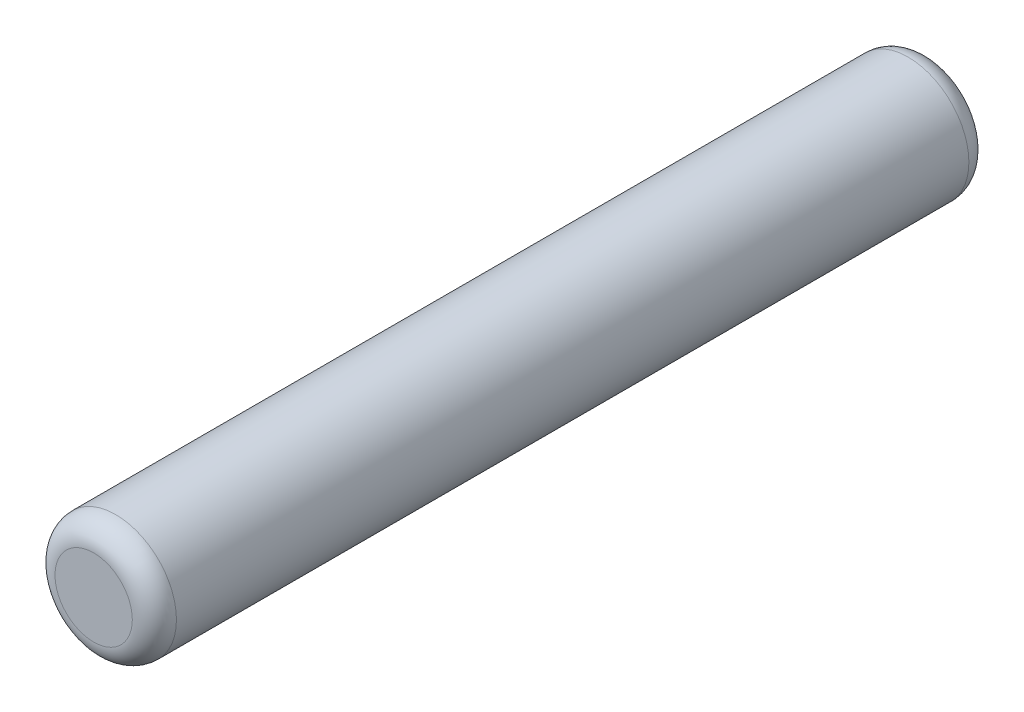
ISO-10303-21;
HEADER;
FILE_DESCRIPTION(('STEP AP214'),'2;1');
FILE_NAME('part.step','',(''),(''),'','','');
FILE_SCHEMA(('AUTOMOTIVE_DESIGN { 1 0 10303 214 1 1 1 1 }'));
ENDSEC;
DATA;
#1=APPLICATION_CONTEXT('core data for automotive mechanical design processes');
#2=APPLICATION_PROTOCOL_DEFINITION('international standard','automotive_design',2000,#1);
#3=PRODUCT_CONTEXT('',#1,'mechanical');
#4=PRODUCT('Part','Part','',(#3));
#5=PRODUCT_RELATED_PRODUCT_CATEGORY('part','',(#4));
#6=PRODUCT_DEFINITION_FORMATION('','',#4);
#7=PRODUCT_DEFINITION_CONTEXT('part definition',#1,'design');
#8=PRODUCT_DEFINITION('design','',#6,#7);
#9=PRODUCT_DEFINITION_SHAPE('','',#8);
#10=(LENGTH_UNIT() NAMED_UNIT(*) SI_UNIT(.MILLI.,.METRE.));
#11=(NAMED_UNIT(*) PLANE_ANGLE_UNIT() SI_UNIT($,.RADIAN.));
#12=(NAMED_UNIT(*) SI_UNIT($,.STERADIAN.) SOLID_ANGLE_UNIT());
#13=UNCERTAINTY_MEASURE_WITH_UNIT(LENGTH_MEASURE(1.E-05),#10,'distance_accuracy_value','');
#14=(GEOMETRIC_REPRESENTATION_CONTEXT(3) GLOBAL_UNCERTAINTY_ASSIGNED_CONTEXT((#13)) GLOBAL_UNIT_ASSIGNED_CONTEXT((#10,
#11,#12)) REPRESENTATION_CONTEXT('',''));
#15=CARTESIAN_POINT('',(0.,0.,0.));
#16=DIRECTION('',(0.,0.,1.));
#17=DIRECTION('',(1.,0.,0.));
#18=AXIS2_PLACEMENT_3D('',#15,#16,#17);
#19=CARTESIAN_POINT('',(0.,0.,-15.0495));
#20=DIRECTION('',(0.,0.,1.));
#21=DIRECTION('',(1.,0.,0.));
#22=AXIS2_PLACEMENT_3D('',#19,#20,#21);
#23=PLANE('',#22);
#24=CARTESIAN_POINT('',(0.,0.,-15.0495));
#25=DIRECTION('',(0.,0.,1.));
#26=DIRECTION('',(1.,0.,0.));
#27=AXIS2_PLACEMENT_3D('',#24,#25,#26);
#28=CIRCLE('',#27,1.39065);
#29=CARTESIAN_POINT('',(1.39065,0.,-15.0495));
#30=VERTEX_POINT('',#29);
#31=EDGE_CURVE('E10',#30,#30,#28,.T.);
#32=ORIENTED_EDGE('',*,*,#31,.F.);
#33=EDGE_LOOP('',(#32));
#34=FACE_BOUND('',#33,.T.);
#35=ADVANCED_FACE('F33',(#34),#23,.F.);
#36=CARTESIAN_POINT('',(0.,0.,-14.25575));
#37=DIRECTION('',(0.,0.,1.));
#38=DIRECTION('',(1.,0.,0.));
#39=AXIS2_PLACEMENT_3D('',#36,#37,#38);
#40=TOROIDAL_SURFACE('',#39,1.39065,0.79375);
#41=CARTESIAN_POINT('',(0.,0.,-14.25575));
#42=DIRECTION('',(0.,0.,1.));
#43=DIRECTION('',(1.,0.,0.));
#44=AXIS2_PLACEMENT_3D('',#41,#42,#43);
#45=CIRCLE('',#44,2.1844);
#46=CARTESIAN_POINT('',(2.1844,0.,-14.25575));
#47=VERTEX_POINT('',#46);
#48=EDGE_CURVE('E39',#47,#47,#45,.T.);
#49=ORIENTED_EDGE('',*,*,#48,.F.);
#50=EDGE_LOOP('',(#49));
#51=FACE_BOUND('',#50,.T.);
#52=ORIENTED_EDGE('',*,*,#31,.T.);
#53=EDGE_LOOP('',(#52));
#54=FACE_BOUND('',#53,.T.);
#55=ADVANCED_FACE('F63',(#51,#54),#40,.T.);
#56=CARTESIAN_POINT('',(0.,0.,40.4232739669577));
#57=DIRECTION('',(0.,0.,1.));
#58=DIRECTION('',(1.,0.,0.));
#59=AXIS2_PLACEMENT_3D('',#56,#57,#58);
#60=CYLINDRICAL_SURFACE('',#59,2.1844);
#61=CARTESIAN_POINT('',(0.,0.,14.25575));
#62=DIRECTION('',(0.,0.,1.));
#63=DIRECTION('',(1.,0.,0.));
#64=AXIS2_PLACEMENT_3D('',#61,#62,#63);
#65=CIRCLE('',#64,2.1844);
#66=CARTESIAN_POINT('',(2.1844,0.,14.25575));
#67=VERTEX_POINT('',#66);
#68=EDGE_CURVE('E43',#67,#67,#65,.T.);
#69=ORIENTED_EDGE('',*,*,#68,.F.);
#70=EDGE_LOOP('',(#69));
#71=FACE_BOUND('',#70,.T.);
#72=ORIENTED_EDGE('',*,*,#48,.T.);
#73=EDGE_LOOP('',(#72));
#74=FACE_BOUND('',#73,.T.);
#75=ADVANCED_FACE('F58',(#71,#74),#60,.T.);
#76=CARTESIAN_POINT('',(0.,0.,14.25575));
#77=DIRECTION('',(0.,0.,1.));
#78=DIRECTION('',(1.,0.,0.));
#79=AXIS2_PLACEMENT_3D('',#76,#77,#78);
#80=TOROIDAL_SURFACE('',#79,1.39065,0.79375);
#81=CARTESIAN_POINT('',(0.,0.,15.0495));
#82=DIRECTION('',(0.,0.,1.));
#83=DIRECTION('',(1.,0.,0.));
#84=AXIS2_PLACEMENT_3D('',#81,#82,#83);
#85=CIRCLE('',#84,1.39065);
#86=CARTESIAN_POINT('',(1.39065,0.,15.0495));
#87=VERTEX_POINT('',#86);
#88=EDGE_CURVE('E47',#87,#87,#85,.T.);
#89=ORIENTED_EDGE('',*,*,#88,.F.);
#90=EDGE_LOOP('',(#89));
#91=FACE_BOUND('',#90,.T.);
#92=ORIENTED_EDGE('',*,*,#68,.T.);
#93=EDGE_LOOP('',(#92));
#94=FACE_BOUND('',#93,.T.);
#95=ADVANCED_FACE('F55',(#91,#94),#80,.T.);
#96=CARTESIAN_POINT('',(0.,0.,15.0495));
#97=DIRECTION('',(0.,0.,-1.));
#98=DIRECTION('',(-1.,0.,0.));
#99=AXIS2_PLACEMENT_3D('',#96,#97,#98);
#100=PLANE('',#99);
#101=ORIENTED_EDGE('',*,*,#88,.T.);
#102=EDGE_LOOP('',(#101));
#103=FACE_BOUND('',#102,.T.);
#104=ADVANCED_FACE('F53',(#103),#100,.F.);
#105=CLOSED_SHELL('',(#35,#55,#75,#95,#104));
#106=MANIFOLD_SOLID_BREP('B2',#105);
#107=ADVANCED_BREP_SHAPE_REPRESENTATION('',(#18,#106),#14);
#108=SHAPE_DEFINITION_REPRESENTATION(#9,#107);
ENDSEC;
END-ISO-10303-21;
